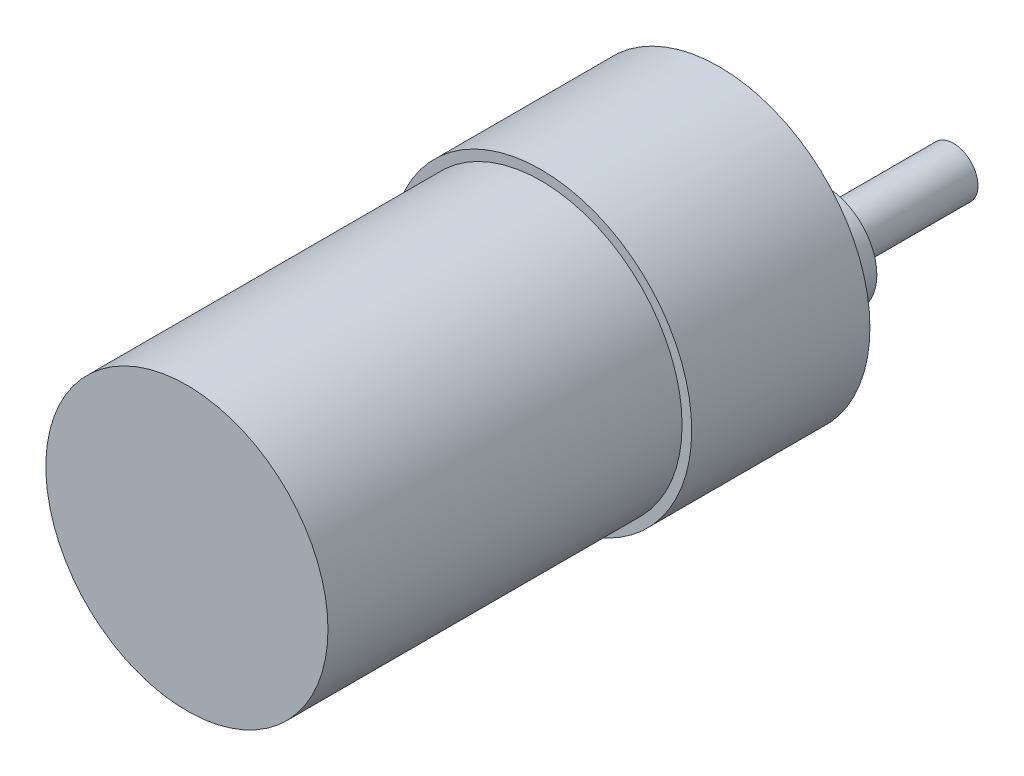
ISO-10303-21;
HEADER;
FILE_DESCRIPTION(('STEP AP214'),'2;1');
FILE_NAME('part.step','',(''),(''),'','','');
FILE_SCHEMA(('AUTOMOTIVE_DESIGN { 1 0 10303 214 1 1 1 1 }'));
ENDSEC;
DATA;
#1=APPLICATION_CONTEXT('core data for automotive mechanical design processes');
#2=APPLICATION_PROTOCOL_DEFINITION('international standard','automotive_design',2000,#1);
#3=PRODUCT_CONTEXT('',#1,'mechanical');
#4=PRODUCT('Part','Part','',(#3));
#5=PRODUCT_RELATED_PRODUCT_CATEGORY('part','',(#4));
#6=PRODUCT_DEFINITION_FORMATION('','',#4);
#7=PRODUCT_DEFINITION_CONTEXT('part definition',#1,'design');
#8=PRODUCT_DEFINITION('design','',#6,#7);
#9=PRODUCT_DEFINITION_SHAPE('','',#8);
#10=(LENGTH_UNIT() NAMED_UNIT(*) SI_UNIT(.MILLI.,.METRE.));
#11=(NAMED_UNIT(*) PLANE_ANGLE_UNIT() SI_UNIT($,.RADIAN.));
#12=(NAMED_UNIT(*) SI_UNIT($,.STERADIAN.) SOLID_ANGLE_UNIT());
#13=UNCERTAINTY_MEASURE_WITH_UNIT(LENGTH_MEASURE(1.E-05),#10,'distance_accuracy_value','');
#14=(GEOMETRIC_REPRESENTATION_CONTEXT(3) GLOBAL_UNCERTAINTY_ASSIGNED_CONTEXT((#13)) GLOBAL_UNIT_ASSIGNED_CONTEXT((#10,
#11,#12)) REPRESENTATION_CONTEXT('',''));
#15=CARTESIAN_POINT('',(0.,0.,0.));
#16=DIRECTION('',(0.,0.,1.));
#17=DIRECTION('',(1.,0.,0.));
#18=AXIS2_PLACEMENT_3D('',#15,#16,#17);
#19=CARTESIAN_POINT('',(0.,0.,0.));
#20=DIRECTION('',(0.,0.,1.));
#21=DIRECTION('',(1.,0.,0.));
#22=AXIS2_PLACEMENT_3D('',#19,#20,#21);
#23=PLANE('',#22);
#24=CARTESIAN_POINT('',(-13.4233937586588,7.75,0.));
#25=DIRECTION('',(0.,0.,-1.));
#26=DIRECTION('',(-1.,0.,0.));
#27=AXIS2_PLACEMENT_3D('',#24,#25,#26);
#28=CIRCLE('',#27,1.49999999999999);
#29=CARTESIAN_POINT('',(-14.9233937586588,7.75,0.));
#30=VERTEX_POINT('',#29);
#31=EDGE_CURVE('E483',#30,#30,#28,.T.);
#32=ORIENTED_EDGE('',*,*,#31,.F.);
#33=EDGE_LOOP('',(#32));
#34=FACE_BOUND('',#33,.T.);
#35=CARTESIAN_POINT('',(0.,15.5,0.));
#36=DIRECTION('',(0.,0.,-1.));
#37=DIRECTION('',(-1.,0.,0.));
#38=AXIS2_PLACEMENT_3D('',#35,#36,#37);
#39=CIRCLE('',#38,1.49999999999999);
#40=CARTESIAN_POINT('',(-1.49999999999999,15.5,0.));
#41=VERTEX_POINT('',#40);
#42=EDGE_CURVE('E74',#41,#41,#39,.T.);
#43=ORIENTED_EDGE('',*,*,#42,.F.);
#44=EDGE_LOOP('',(#43));
#45=FACE_BOUND('',#44,.T.);
#46=CARTESIAN_POINT('',(13.4233937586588,7.75000000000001,0.));
#47=DIRECTION('',(0.,0.,-1.));
#48=DIRECTION('',(-1.,0.,0.));
#49=AXIS2_PLACEMENT_3D('',#46,#47,#48);
#50=CIRCLE('',#49,1.49999999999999);
#51=CARTESIAN_POINT('',(11.9233937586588,7.75000000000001,0.));
#52=VERTEX_POINT('',#51);
#53=EDGE_CURVE('E93',#52,#52,#50,.T.);
#54=ORIENTED_EDGE('',*,*,#53,.F.);
#55=EDGE_LOOP('',(#54));
#56=FACE_BOUND('',#55,.T.);
#57=CARTESIAN_POINT('',(13.4233937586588,-7.75,0.));
#58=DIRECTION('',(0.,0.,-1.));
#59=DIRECTION('',(-1.,0.,0.));
#60=AXIS2_PLACEMENT_3D('',#57,#58,#59);
#61=CIRCLE('',#60,1.49999999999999);
#62=CARTESIAN_POINT('',(11.9233937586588,-7.75,0.));
#63=VERTEX_POINT('',#62);
#64=EDGE_CURVE('E105',#63,#63,#61,.T.);
#65=ORIENTED_EDGE('',*,*,#64,.F.);
#66=EDGE_LOOP('',(#65));
#67=FACE_BOUND('',#66,.T.);
#68=CARTESIAN_POINT('',(0.,-15.5,0.));
#69=DIRECTION('',(0.,0.,-1.));
#70=DIRECTION('',(-1.,0.,0.));
#71=AXIS2_PLACEMENT_3D('',#68,#69,#70);
#72=CIRCLE('',#71,1.49999999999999);
#73=CARTESIAN_POINT('',(-1.49999999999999,-15.5,0.));
#74=VERTEX_POINT('',#73);
#75=EDGE_CURVE('E117',#74,#74,#72,.T.);
#76=ORIENTED_EDGE('',*,*,#75,.F.);
#77=EDGE_LOOP('',(#76));
#78=FACE_BOUND('',#77,.T.);
#79=CARTESIAN_POINT('',(-13.4233937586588,-7.75000000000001,0.));
#80=DIRECTION('',(0.,0.,-1.));
#81=DIRECTION('',(-1.,0.,0.));
#82=AXIS2_PLACEMENT_3D('',#79,#80,#81);
#83=CIRCLE('',#82,1.49999999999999);
#84=CARTESIAN_POINT('',(-14.9233937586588,-7.75000000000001,0.));
#85=VERTEX_POINT('',#84);
#86=EDGE_CURVE('E129',#85,#85,#83,.T.);
#87=ORIENTED_EDGE('',*,*,#86,.F.);
#88=EDGE_LOOP('',(#87));
#89=FACE_BOUND('',#88,.T.);
#90=CARTESIAN_POINT('',(0.,0.,0.));
#91=DIRECTION('',(0.,0.,1.));
#92=DIRECTION('',(1.,0.,0.));
#93=AXIS2_PLACEMENT_3D('',#90,#91,#92);
#94=CIRCLE('',#93,18.4);
#95=CARTESIAN_POINT('',(18.4,0.,0.));
#96=VERTEX_POINT('',#95);
#97=EDGE_CURVE('E156',#96,#96,#94,.T.);
#98=ORIENTED_EDGE('',*,*,#97,.F.);
#99=EDGE_LOOP('',(#98));
#100=FACE_BOUND('',#99,.T.);
#101=CARTESIAN_POINT('',(7.,0.,0.));
#102=DIRECTION('',(0.,0.,1.));
#103=DIRECTION('',(1.,0.,0.));
#104=AXIS2_PLACEMENT_3D('',#101,#102,#103);
#105=CIRCLE('',#104,6.25);
#106=CARTESIAN_POINT('',(13.25,0.,0.));
#107=VERTEX_POINT('',#106);
#108=EDGE_CURVE('E11',#107,#107,#105,.F.);
#109=ORIENTED_EDGE('',*,*,#108,.F.);
#110=EDGE_LOOP('',(#109));
#111=FACE_BOUND('',#110,.T.);
#112=ADVANCED_FACE('F37',(#34,#45,#56,#67,#78,#89,#100,#111),#23,.F.);
#113=CARTESIAN_POINT('',(0.,0.,21.76));
#114=DIRECTION('',(0.,0.,1.));
#115=DIRECTION('',(1.,0.,0.));
#116=AXIS2_PLACEMENT_3D('',#113,#114,#115);
#117=PLANE('',#116);
#118=CARTESIAN_POINT('',(0.,0.,21.76));
#119=DIRECTION('',(0.,0.,1.));
#120=DIRECTION('',(1.,0.,0.));
#121=AXIS2_PLACEMENT_3D('',#118,#119,#120);
#122=CIRCLE('',#121,18.4);
#123=CARTESIAN_POINT('',(18.4,0.,21.76));
#124=VERTEX_POINT('',#123);
#125=EDGE_CURVE('E45',#124,#124,#122,.T.);
#126=ORIENTED_EDGE('',*,*,#125,.T.);
#127=EDGE_LOOP('',(#126));
#128=FACE_BOUND('',#127,.T.);
#129=CARTESIAN_POINT('',(0.,0.,21.76));
#130=DIRECTION('',(0.,0.,1.));
#131=DIRECTION('',(1.,0.,0.));
#132=AXIS2_PLACEMENT_3D('',#129,#130,#131);
#133=CIRCLE('',#132,17.225);
#134=CARTESIAN_POINT('',(17.225,0.,21.76));
#135=VERTEX_POINT('',#134);
#136=EDGE_CURVE('E153',#135,#135,#133,.F.);
#137=ORIENTED_EDGE('',*,*,#136,.T.);
#138=EDGE_LOOP('',(#137));
#139=FACE_BOUND('',#138,.T.);
#140=ADVANCED_FACE('F164',(#128,#139),#117,.T.);
#141=CARTESIAN_POINT('',(0.,0.,21.76));
#142=DIRECTION('',(0.,0.,-1.));
#143=DIRECTION('',(-1.,0.,0.));
#144=AXIS2_PLACEMENT_3D('',#141,#142,#143);
#145=CYLINDRICAL_SURFACE('',#144,18.4);
#146=ORIENTED_EDGE('',*,*,#125,.F.);
#147=EDGE_LOOP('',(#146));
#148=FACE_BOUND('',#147,.T.);
#149=ORIENTED_EDGE('',*,*,#97,.T.);
#150=EDGE_LOOP('',(#149));
#151=FACE_BOUND('',#150,.T.);
#152=ADVANCED_FACE('F39',(#148,#151),#145,.T.);
#153=CARTESIAN_POINT('',(0.,0.,65.));
#154=DIRECTION('',(0.,0.,-1.));
#155=DIRECTION('',(-1.,0.,0.));
#156=AXIS2_PLACEMENT_3D('',#153,#154,#155);
#157=CYLINDRICAL_SURFACE('',#156,17.225);
#158=ORIENTED_EDGE('',*,*,#136,.F.);
#159=EDGE_LOOP('',(#158));
#160=FACE_BOUND('',#159,.T.);
#161=CARTESIAN_POINT('',(0.,0.,65.));
#162=DIRECTION('',(0.,0.,1.));
#163=DIRECTION('',(1.,0.,0.));
#164=AXIS2_PLACEMENT_3D('',#161,#162,#163);
#165=CIRCLE('',#164,17.225);
#166=CARTESIAN_POINT('',(17.225,0.,65.));
#167=VERTEX_POINT('',#166);
#168=EDGE_CURVE('E150',#167,#167,#165,.T.);
#169=ORIENTED_EDGE('',*,*,#168,.F.);
#170=EDGE_LOOP('',(#169));
#171=FACE_BOUND('',#170,.T.);
#172=ADVANCED_FACE('F200',(#160,#171),#157,.T.);
#173=CARTESIAN_POINT('',(0.,0.,65.));
#174=DIRECTION('',(0.,0.,1.));
#175=DIRECTION('',(1.,0.,0.));
#176=AXIS2_PLACEMENT_3D('',#173,#174,#175);
#177=PLANE('',#176);
#178=ORIENTED_EDGE('',*,*,#168,.T.);
#179=EDGE_LOOP('',(#178));
#180=FACE_BOUND('',#179,.T.);
#181=ADVANCED_FACE('F184',(#180),#177,.T.);
#182=CARTESIAN_POINT('',(7.,0.,0.));
#183=DIRECTION('',(0.,0.,1.));
#184=DIRECTION('',(1.,0.,0.));
#185=AXIS2_PLACEMENT_3D('',#182,#183,#184);
#186=CYLINDRICAL_SURFACE('',#185,3.);
#187=CARTESIAN_POINT('',(7.,0.,-6.));
#188=DIRECTION('',(0.,0.,1.));
#189=DIRECTION('',(1.,0.,0.));
#190=AXIS2_PLACEMENT_3D('',#187,#188,#189);
#191=CIRCLE('',#190,3.);
#192=CARTESIAN_POINT('',(10.,0.,-6.));
#193=VERTEX_POINT('',#192);
#194=EDGE_CURVE('E147',#193,#193,#191,.T.);
#195=ORIENTED_EDGE('',*,*,#194,.F.);
#196=EDGE_LOOP('',(#195));
#197=FACE_BOUND('',#196,.T.);
#198=CARTESIAN_POINT('',(7.,0.,-21.6));
#199=DIRECTION('',(0.,0.,1.));
#200=DIRECTION('',(1.,0.,0.));
#201=AXIS2_PLACEMENT_3D('',#198,#199,#200);
#202=CIRCLE('',#201,3.);
#203=CARTESIAN_POINT('',(10.,0.,-21.6));
#204=VERTEX_POINT('',#203);
#205=EDGE_CURVE('E141',#204,#204,#202,.T.);
#206=ORIENTED_EDGE('',*,*,#205,.T.);
#207=EDGE_LOOP('',(#206));
#208=FACE_BOUND('',#207,.T.);
#209=ADVANCED_FACE('F178',(#197,#208),#186,.T.);
#210=CARTESIAN_POINT('',(0.749999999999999,0.,-6.));
#211=DIRECTION('',(0.,0.,1.));
#212=DIRECTION('',(1.,0.,0.));
#213=AXIS2_PLACEMENT_3D('',#210,#211,#212);
#214=PLANE('',#213);
#215=CARTESIAN_POINT('',(7.,0.,-6.));
#216=DIRECTION('',(0.,0.,1.));
#217=DIRECTION('',(1.,0.,0.));
#218=AXIS2_PLACEMENT_3D('',#215,#216,#217);
#219=CIRCLE('',#218,6.25);
#220=CARTESIAN_POINT('',(13.25,0.,-6.));
#221=VERTEX_POINT('',#220);
#222=EDGE_CURVE('E144',#221,#221,#219,.T.);
#223=ORIENTED_EDGE('',*,*,#222,.F.);
#224=EDGE_LOOP('',(#223));
#225=FACE_BOUND('',#224,.T.);
#226=ORIENTED_EDGE('',*,*,#194,.T.);
#227=EDGE_LOOP('',(#226));
#228=FACE_BOUND('',#227,.T.);
#229=ADVANCED_FACE('F172',(#225,#228),#214,.F.);
#230=CARTESIAN_POINT('',(7.,0.,0.));
#231=DIRECTION('',(0.,0.,1.));
#232=DIRECTION('',(1.,0.,0.));
#233=AXIS2_PLACEMENT_3D('',#230,#231,#232);
#234=CYLINDRICAL_SURFACE('',#233,6.25);
#235=ORIENTED_EDGE('',*,*,#108,.T.);
#236=EDGE_LOOP('',(#235));
#237=FACE_BOUND('',#236,.T.);
#238=ORIENTED_EDGE('',*,*,#222,.T.);
#239=EDGE_LOOP('',(#238));
#240=FACE_BOUND('',#239,.T.);
#241=ADVANCED_FACE('F168',(#237,#240),#234,.T.);
#242=CARTESIAN_POINT('',(4.,0.,-21.6));
#243=DIRECTION('',(0.,0.,1.));
#244=DIRECTION('',(1.,0.,0.));
#245=AXIS2_PLACEMENT_3D('',#242,#243,#244);
#246=PLANE('',#245);
#247=ORIENTED_EDGE('',*,*,#205,.F.);
#248=EDGE_LOOP('',(#247));
#249=FACE_BOUND('',#248,.T.);
#250=ADVANCED_FACE('F171',(#249),#246,.F.);
#251=CARTESIAN_POINT('',(-13.4233937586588,-7.75000000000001,4.));
#252=DIRECTION('',(0.,0.,-1.));
#253=DIRECTION('',(-1.,0.,0.));
#254=AXIS2_PLACEMENT_3D('',#251,#252,#253);
#255=CONICAL_SURFACE('',#254,1.25,1.02974425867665);
#256=CARTESIAN_POINT('',(-13.4233937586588,-7.75000000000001,4.75107577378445));
#257=VERTEX_POINT('',#256);
#258=VERTEX_LOOP('',#257);
#259=FACE_BOUND('',#258,.T.);
#260=CARTESIAN_POINT('',(-13.4233937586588,-7.75000000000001,4.));
#261=DIRECTION('',(0.,0.,-1.));
#262=DIRECTION('',(-1.,0.,0.));
#263=AXIS2_PLACEMENT_3D('',#260,#261,#262);
#264=CIRCLE('',#263,1.25);
#265=CARTESIAN_POINT('',(-14.6733937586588,-7.75000000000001,4.));
#266=VERTEX_POINT('',#265);
#267=EDGE_CURVE('E138',#266,#266,#264,.T.);
#268=ORIENTED_EDGE('',*,*,#267,.T.);
#269=EDGE_LOOP('',(#268));
#270=FACE_BOUND('',#269,.T.);
#271=ADVANCED_FACE('F189',(#259,#270),#255,.F.);
#272=CARTESIAN_POINT('',(-13.4233937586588,-7.75000000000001,0.));
#273=DIRECTION('',(0.,0.,-1.));
#274=DIRECTION('',(-1.,0.,0.));
#275=AXIS2_PLACEMENT_3D('',#272,#273,#274);
#276=CYLINDRICAL_SURFACE('',#275,1.25);
#277=ORIENTED_EDGE('',*,*,#267,.F.);
#278=EDGE_LOOP('',(#277));
#279=FACE_BOUND('',#278,.T.);
#280=CARTESIAN_POINT('',(-13.4233937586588,-7.75000000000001,3.5));
#281=DIRECTION('',(0.,0.,-1.));
#282=DIRECTION('',(-1.,0.,0.));
#283=AXIS2_PLACEMENT_3D('',#280,#281,#282);
#284=CIRCLE('',#283,1.25);
#285=CARTESIAN_POINT('',(-14.6733937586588,-7.75000000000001,3.5));
#286=VERTEX_POINT('',#285);
#287=EDGE_CURVE('E135',#286,#286,#284,.T.);
#288=ORIENTED_EDGE('',*,*,#287,.T.);
#289=EDGE_LOOP('',(#288));
#290=FACE_BOUND('',#289,.T.);
#291=ADVANCED_FACE('F194',(#279,#290),#276,.F.);
#292=CARTESIAN_POINT('',(-12.1733937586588,-7.75000000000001,3.5));
#293=DIRECTION('',(0.,0.,1.));
#294=DIRECTION('',(1.,0.,0.));
#295=AXIS2_PLACEMENT_3D('',#292,#293,#294);
#296=PLANE('',#295);
#297=ORIENTED_EDGE('',*,*,#287,.F.);
#298=EDGE_LOOP('',(#297));
#299=FACE_BOUND('',#298,.T.);
#300=CARTESIAN_POINT('',(-13.4233937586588,-7.75000000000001,3.5));
#301=DIRECTION('',(0.,0.,-1.));
#302=DIRECTION('',(-1.,0.,0.));
#303=AXIS2_PLACEMENT_3D('',#300,#301,#302);
#304=CIRCLE('',#303,1.5);
#305=CARTESIAN_POINT('',(-14.9233937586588,-7.75000000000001,3.5));
#306=VERTEX_POINT('',#305);
#307=EDGE_CURVE('E132',#306,#306,#304,.T.);
#308=ORIENTED_EDGE('',*,*,#307,.T.);
#309=EDGE_LOOP('',(#308));
#310=FACE_BOUND('',#309,.T.);
#311=ADVANCED_FACE('F263',(#299,#310),#296,.F.);
#312=CARTESIAN_POINT('',(-13.4233937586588,-7.75000000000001,0.));
#313=DIRECTION('',(0.,0.,-1.));
#314=DIRECTION('',(-1.,0.,0.));
#315=AXIS2_PLACEMENT_3D('',#312,#313,#314);
#316=CYLINDRICAL_SURFACE('',#315,1.5);
#317=ORIENTED_EDGE('',*,*,#307,.F.);
#318=EDGE_LOOP('',(#317));
#319=FACE_BOUND('',#318,.T.);
#320=ORIENTED_EDGE('',*,*,#86,.T.);
#321=EDGE_LOOP('',(#320));
#322=FACE_BOUND('',#321,.T.);
#323=ADVANCED_FACE('F272',(#319,#322),#316,.F.);
#324=CARTESIAN_POINT('',(0.,-15.5,4.));
#325=DIRECTION('',(0.,0.,-1.));
#326=DIRECTION('',(-1.,0.,0.));
#327=AXIS2_PLACEMENT_3D('',#324,#325,#326);
#328=CONICAL_SURFACE('',#327,1.25,1.02974425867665);
#329=CARTESIAN_POINT('',(0.,-15.5,4.75107577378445));
#330=VERTEX_POINT('',#329);
#331=VERTEX_LOOP('',#330);
#332=FACE_BOUND('',#331,.T.);
#333=CARTESIAN_POINT('',(0.,-15.5,4.));
#334=DIRECTION('',(0.,0.,-1.));
#335=DIRECTION('',(-1.,0.,0.));
#336=AXIS2_PLACEMENT_3D('',#333,#334,#335);
#337=CIRCLE('',#336,1.25);
#338=CARTESIAN_POINT('',(-1.25,-15.5,4.));
#339=VERTEX_POINT('',#338);
#340=EDGE_CURVE('E126',#339,#339,#337,.T.);
#341=ORIENTED_EDGE('',*,*,#340,.T.);
#342=EDGE_LOOP('',(#341));
#343=FACE_BOUND('',#342,.T.);
#344=ADVANCED_FACE('F282',(#332,#343),#328,.F.);
#345=CARTESIAN_POINT('',(0.,-15.5,0.));
#346=DIRECTION('',(0.,0.,-1.));
#347=DIRECTION('',(-1.,0.,0.));
#348=AXIS2_PLACEMENT_3D('',#345,#346,#347);
#349=CYLINDRICAL_SURFACE('',#348,1.25);
#350=ORIENTED_EDGE('',*,*,#340,.F.);
#351=EDGE_LOOP('',(#350));
#352=FACE_BOUND('',#351,.T.);
#353=CARTESIAN_POINT('',(0.,-15.5,3.5));
#354=DIRECTION('',(0.,0.,-1.));
#355=DIRECTION('',(-1.,0.,0.));
#356=AXIS2_PLACEMENT_3D('',#353,#354,#355);
#357=CIRCLE('',#356,1.25);
#358=CARTESIAN_POINT('',(-1.25,-15.5,3.5));
#359=VERTEX_POINT('',#358);
#360=EDGE_CURVE('E123',#359,#359,#357,.T.);
#361=ORIENTED_EDGE('',*,*,#360,.T.);
#362=EDGE_LOOP('',(#361));
#363=FACE_BOUND('',#362,.T.);
#364=ADVANCED_FACE('F292',(#352,#363),#349,.F.);
#365=CARTESIAN_POINT('',(1.25,-15.5,3.5));
#366=DIRECTION('',(0.,0.,1.));
#367=DIRECTION('',(1.,0.,0.));
#368=AXIS2_PLACEMENT_3D('',#365,#366,#367);
#369=PLANE('',#368);
#370=ORIENTED_EDGE('',*,*,#360,.F.);
#371=EDGE_LOOP('',(#370));
#372=FACE_BOUND('',#371,.T.);
#373=CARTESIAN_POINT('',(0.,-15.5,3.5));
#374=DIRECTION('',(0.,0.,-1.));
#375=DIRECTION('',(-1.,0.,0.));
#376=AXIS2_PLACEMENT_3D('',#373,#374,#375);
#377=CIRCLE('',#376,1.5);
#378=CARTESIAN_POINT('',(-1.5,-15.5,3.5));
#379=VERTEX_POINT('',#378);
#380=EDGE_CURVE('E120',#379,#379,#377,.T.);
#381=ORIENTED_EDGE('',*,*,#380,.T.);
#382=EDGE_LOOP('',(#381));
#383=FACE_BOUND('',#382,.T.);
#384=ADVANCED_FACE('F301',(#372,#383),#369,.F.);
#385=CARTESIAN_POINT('',(0.,-15.5,0.));
#386=DIRECTION('',(0.,0.,-1.));
#387=DIRECTION('',(-1.,0.,0.));
#388=AXIS2_PLACEMENT_3D('',#385,#386,#387);
#389=CYLINDRICAL_SURFACE('',#388,1.5);
#390=ORIENTED_EDGE('',*,*,#380,.F.);
#391=EDGE_LOOP('',(#390));
#392=FACE_BOUND('',#391,.T.);
#393=ORIENTED_EDGE('',*,*,#75,.T.);
#394=EDGE_LOOP('',(#393));
#395=FACE_BOUND('',#394,.T.);
#396=ADVANCED_FACE('F311',(#392,#395),#389,.F.);
#397=CARTESIAN_POINT('',(13.4233937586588,-7.75,4.));
#398=DIRECTION('',(0.,0.,-1.));
#399=DIRECTION('',(-1.,0.,0.));
#400=AXIS2_PLACEMENT_3D('',#397,#398,#399);
#401=CONICAL_SURFACE('',#400,1.25,1.02974425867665);
#402=CARTESIAN_POINT('',(13.4233937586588,-7.75,4.75107577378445));
#403=VERTEX_POINT('',#402);
#404=VERTEX_LOOP('',#403);
#405=FACE_BOUND('',#404,.T.);
#406=CARTESIAN_POINT('',(13.4233937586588,-7.75,4.));
#407=DIRECTION('',(0.,0.,-1.));
#408=DIRECTION('',(-1.,0.,0.));
#409=AXIS2_PLACEMENT_3D('',#406,#407,#408);
#410=CIRCLE('',#409,1.25);
#411=CARTESIAN_POINT('',(12.1733937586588,-7.75,4.));
#412=VERTEX_POINT('',#411);
#413=EDGE_CURVE('E114',#412,#412,#410,.T.);
#414=ORIENTED_EDGE('',*,*,#413,.T.);
#415=EDGE_LOOP('',(#414));
#416=FACE_BOUND('',#415,.T.);
#417=ADVANCED_FACE('F321',(#405,#416),#401,.F.);
#418=CARTESIAN_POINT('',(13.4233937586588,-7.75,0.));
#419=DIRECTION('',(0.,0.,-1.));
#420=DIRECTION('',(-1.,0.,0.));
#421=AXIS2_PLACEMENT_3D('',#418,#419,#420);
#422=CYLINDRICAL_SURFACE('',#421,1.25);
#423=ORIENTED_EDGE('',*,*,#413,.F.);
#424=EDGE_LOOP('',(#423));
#425=FACE_BOUND('',#424,.T.);
#426=CARTESIAN_POINT('',(13.4233937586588,-7.75,3.5));
#427=DIRECTION('',(0.,0.,-1.));
#428=DIRECTION('',(-1.,0.,0.));
#429=AXIS2_PLACEMENT_3D('',#426,#427,#428);
#430=CIRCLE('',#429,1.25);
#431=CARTESIAN_POINT('',(12.1733937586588,-7.75,3.5));
#432=VERTEX_POINT('',#431);
#433=EDGE_CURVE('E111',#432,#432,#430,.T.);
#434=ORIENTED_EDGE('',*,*,#433,.T.);
#435=EDGE_LOOP('',(#434));
#436=FACE_BOUND('',#435,.T.);
#437=ADVANCED_FACE('F331',(#425,#436),#422,.F.);
#438=CARTESIAN_POINT('',(14.6733937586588,-7.75,3.5));
#439=DIRECTION('',(0.,0.,1.));
#440=DIRECTION('',(1.,0.,0.));
#441=AXIS2_PLACEMENT_3D('',#438,#439,#440);
#442=PLANE('',#441);
#443=ORIENTED_EDGE('',*,*,#433,.F.);
#444=EDGE_LOOP('',(#443));
#445=FACE_BOUND('',#444,.T.);
#446=CARTESIAN_POINT('',(13.4233937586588,-7.75,3.5));
#447=DIRECTION('',(0.,0.,-1.));
#448=DIRECTION('',(-1.,0.,0.));
#449=AXIS2_PLACEMENT_3D('',#446,#447,#448);
#450=CIRCLE('',#449,1.5);
#451=CARTESIAN_POINT('',(11.9233937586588,-7.75,3.5));
#452=VERTEX_POINT('',#451);
#453=EDGE_CURVE('E108',#452,#452,#450,.T.);
#454=ORIENTED_EDGE('',*,*,#453,.T.);
#455=EDGE_LOOP('',(#454));
#456=FACE_BOUND('',#455,.T.);
#457=ADVANCED_FACE('F341',(#445,#456),#442,.F.);
#458=CARTESIAN_POINT('',(13.4233937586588,-7.75,0.));
#459=DIRECTION('',(0.,0.,-1.));
#460=DIRECTION('',(-1.,0.,0.));
#461=AXIS2_PLACEMENT_3D('',#458,#459,#460);
#462=CYLINDRICAL_SURFACE('',#461,1.5);
#463=ORIENTED_EDGE('',*,*,#453,.F.);
#464=EDGE_LOOP('',(#463));
#465=FACE_BOUND('',#464,.T.);
#466=ORIENTED_EDGE('',*,*,#64,.T.);
#467=EDGE_LOOP('',(#466));
#468=FACE_BOUND('',#467,.T.);
#469=ADVANCED_FACE('F351',(#465,#468),#462,.F.);
#470=CARTESIAN_POINT('',(13.4233937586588,7.75000000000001,4.));
#471=DIRECTION('',(0.,0.,-1.));
#472=DIRECTION('',(-1.,0.,0.));
#473=AXIS2_PLACEMENT_3D('',#470,#471,#472);
#474=CONICAL_SURFACE('',#473,1.25,1.02974425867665);
#475=CARTESIAN_POINT('',(13.4233937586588,7.75000000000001,4.75107577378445));
#476=VERTEX_POINT('',#475);
#477=VERTEX_LOOP('',#476);
#478=FACE_BOUND('',#477,.T.);
#479=CARTESIAN_POINT('',(13.4233937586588,7.75000000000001,4.));
#480=DIRECTION('',(0.,0.,-1.));
#481=DIRECTION('',(-1.,0.,0.));
#482=AXIS2_PLACEMENT_3D('',#479,#480,#481);
#483=CIRCLE('',#482,1.25);
#484=CARTESIAN_POINT('',(12.1733937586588,7.75000000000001,4.));
#485=VERTEX_POINT('',#484);
#486=EDGE_CURVE('E102',#485,#485,#483,.T.);
#487=ORIENTED_EDGE('',*,*,#486,.T.);
#488=EDGE_LOOP('',(#487));
#489=FACE_BOUND('',#488,.T.);
#490=ADVANCED_FACE('F361',(#478,#489),#474,.F.);
#491=CARTESIAN_POINT('',(13.4233937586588,7.75000000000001,0.));
#492=DIRECTION('',(0.,0.,-1.));
#493=DIRECTION('',(-1.,0.,0.));
#494=AXIS2_PLACEMENT_3D('',#491,#492,#493);
#495=CYLINDRICAL_SURFACE('',#494,1.25);
#496=ORIENTED_EDGE('',*,*,#486,.F.);
#497=EDGE_LOOP('',(#496));
#498=FACE_BOUND('',#497,.T.);
#499=CARTESIAN_POINT('',(13.4233937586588,7.75000000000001,3.5));
#500=DIRECTION('',(0.,0.,-1.));
#501=DIRECTION('',(-1.,0.,0.));
#502=AXIS2_PLACEMENT_3D('',#499,#500,#501);
#503=CIRCLE('',#502,1.25);
#504=CARTESIAN_POINT('',(12.1733937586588,7.75000000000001,3.5));
#505=VERTEX_POINT('',#504);
#506=EDGE_CURVE('E99',#505,#505,#503,.T.);
#507=ORIENTED_EDGE('',*,*,#506,.T.);
#508=EDGE_LOOP('',(#507));
#509=FACE_BOUND('',#508,.T.);
#510=ADVANCED_FACE('F371',(#498,#509),#495,.F.);
#511=CARTESIAN_POINT('',(14.6733937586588,7.75000000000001,3.5));
#512=DIRECTION('',(0.,0.,1.));
#513=DIRECTION('',(1.,0.,0.));
#514=AXIS2_PLACEMENT_3D('',#511,#512,#513);
#515=PLANE('',#514);
#516=ORIENTED_EDGE('',*,*,#506,.F.);
#517=EDGE_LOOP('',(#516));
#518=FACE_BOUND('',#517,.T.);
#519=CARTESIAN_POINT('',(13.4233937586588,7.75000000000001,3.5));
#520=DIRECTION('',(0.,0.,-1.));
#521=DIRECTION('',(-1.,0.,0.));
#522=AXIS2_PLACEMENT_3D('',#519,#520,#521);
#523=CIRCLE('',#522,1.5);
#524=CARTESIAN_POINT('',(11.9233937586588,7.75000000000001,3.5));
#525=VERTEX_POINT('',#524);
#526=EDGE_CURVE('E96',#525,#525,#523,.T.);
#527=ORIENTED_EDGE('',*,*,#526,.T.);
#528=EDGE_LOOP('',(#527));
#529=FACE_BOUND('',#528,.T.);
#530=ADVANCED_FACE('F381',(#518,#529),#515,.F.);
#531=CARTESIAN_POINT('',(13.4233937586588,7.75000000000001,0.));
#532=DIRECTION('',(0.,0.,-1.));
#533=DIRECTION('',(-1.,0.,0.));
#534=AXIS2_PLACEMENT_3D('',#531,#532,#533);
#535=CYLINDRICAL_SURFACE('',#534,1.5);
#536=ORIENTED_EDGE('',*,*,#526,.F.);
#537=EDGE_LOOP('',(#536));
#538=FACE_BOUND('',#537,.T.);
#539=ORIENTED_EDGE('',*,*,#53,.T.);
#540=EDGE_LOOP('',(#539));
#541=FACE_BOUND('',#540,.T.);
#542=ADVANCED_FACE('F391',(#538,#541),#535,.F.);
#543=CARTESIAN_POINT('',(0.,15.5,4.));
#544=DIRECTION('',(0.,0.,-1.));
#545=DIRECTION('',(-1.,0.,0.));
#546=AXIS2_PLACEMENT_3D('',#543,#544,#545);
#547=CONICAL_SURFACE('',#546,1.25,1.02974425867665);
#548=CARTESIAN_POINT('',(0.,15.5,4.75107577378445));
#549=VERTEX_POINT('',#548);
#550=VERTEX_LOOP('',#549);
#551=FACE_BOUND('',#550,.T.);
#552=CARTESIAN_POINT('',(0.,15.5,4.));
#553=DIRECTION('',(0.,0.,-1.));
#554=DIRECTION('',(-1.,0.,0.));
#555=AXIS2_PLACEMENT_3D('',#552,#553,#554);
#556=CIRCLE('',#555,1.25);
#557=CARTESIAN_POINT('',(-1.25,15.5,4.));
#558=VERTEX_POINT('',#557);
#559=EDGE_CURVE('E90',#558,#558,#556,.T.);
#560=ORIENTED_EDGE('',*,*,#559,.T.);
#561=EDGE_LOOP('',(#560));
#562=FACE_BOUND('',#561,.T.);
#563=ADVANCED_FACE('F401',(#551,#562),#547,.F.);
#564=CARTESIAN_POINT('',(0.,15.5,0.));
#565=DIRECTION('',(0.,0.,-1.));
#566=DIRECTION('',(-1.,0.,0.));
#567=AXIS2_PLACEMENT_3D('',#564,#565,#566);
#568=CYLINDRICAL_SURFACE('',#567,1.25);
#569=ORIENTED_EDGE('',*,*,#559,.F.);
#570=EDGE_LOOP('',(#569));
#571=FACE_BOUND('',#570,.T.);
#572=CARTESIAN_POINT('',(0.,15.5,3.5));
#573=DIRECTION('',(0.,0.,-1.));
#574=DIRECTION('',(-1.,0.,0.));
#575=AXIS2_PLACEMENT_3D('',#572,#573,#574);
#576=CIRCLE('',#575,1.25);
#577=CARTESIAN_POINT('',(-1.25,15.5,3.5));
#578=VERTEX_POINT('',#577);
#579=EDGE_CURVE('E87',#578,#578,#576,.T.);
#580=ORIENTED_EDGE('',*,*,#579,.T.);
#581=EDGE_LOOP('',(#580));
#582=FACE_BOUND('',#581,.T.);
#583=ADVANCED_FACE('F411',(#571,#582),#568,.F.);
#584=CARTESIAN_POINT('',(1.25,15.5,3.5));
#585=DIRECTION('',(0.,0.,1.));
#586=DIRECTION('',(1.,0.,0.));
#587=AXIS2_PLACEMENT_3D('',#584,#585,#586);
#588=PLANE('',#587);
#589=ORIENTED_EDGE('',*,*,#579,.F.);
#590=EDGE_LOOP('',(#589));
#591=FACE_BOUND('',#590,.T.);
#592=CARTESIAN_POINT('',(0.,15.5,3.5));
#593=DIRECTION('',(0.,0.,-1.));
#594=DIRECTION('',(-1.,0.,0.));
#595=AXIS2_PLACEMENT_3D('',#592,#593,#594);
#596=CIRCLE('',#595,1.5);
#597=CARTESIAN_POINT('',(-1.5,15.5,3.5));
#598=VERTEX_POINT('',#597);
#599=EDGE_CURVE('E78',#598,#598,#596,.T.);
#600=ORIENTED_EDGE('',*,*,#599,.T.);
#601=EDGE_LOOP('',(#600));
#602=FACE_BOUND('',#601,.T.);
#603=ADVANCED_FACE('F421',(#591,#602),#588,.F.);
#604=CARTESIAN_POINT('',(0.,15.5,0.));
#605=DIRECTION('',(0.,0.,-1.));
#606=DIRECTION('',(-1.,0.,0.));
#607=AXIS2_PLACEMENT_3D('',#604,#605,#606);
#608=CYLINDRICAL_SURFACE('',#607,1.5);
#609=ORIENTED_EDGE('',*,*,#599,.F.);
#610=EDGE_LOOP('',(#609));
#611=FACE_BOUND('',#610,.T.);
#612=ORIENTED_EDGE('',*,*,#42,.T.);
#613=EDGE_LOOP('',(#612));
#614=FACE_BOUND('',#613,.T.);
#615=ADVANCED_FACE('F68',(#611,#614),#608,.F.);
#616=CARTESIAN_POINT('',(-13.4233937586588,7.75,4.));
#617=DIRECTION('',(0.,0.,-1.));
#618=DIRECTION('',(-1.,0.,0.));
#619=AXIS2_PLACEMENT_3D('',#616,#617,#618);
#620=CONICAL_SURFACE('',#619,1.25,1.02974425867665);
#621=CARTESIAN_POINT('',(-13.4233937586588,7.75,4.75107577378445));
#622=VERTEX_POINT('',#621);
#623=VERTEX_LOOP('',#622);
#624=FACE_BOUND('',#623,.T.);
#625=CARTESIAN_POINT('',(-13.4233937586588,7.75,4.));
#626=DIRECTION('',(0.,0.,-1.));
#627=DIRECTION('',(-1.,0.,0.));
#628=AXIS2_PLACEMENT_3D('',#625,#626,#627);
#629=CIRCLE('',#628,1.25);
#630=CARTESIAN_POINT('',(-14.6733937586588,7.75,4.));
#631=VERTEX_POINT('',#630);
#632=EDGE_CURVE('E72',#631,#631,#629,.T.);
#633=ORIENTED_EDGE('',*,*,#632,.T.);
#634=EDGE_LOOP('',(#633));
#635=FACE_BOUND('',#634,.T.);
#636=ADVANCED_FACE('F64',(#624,#635),#620,.F.);
#637=CARTESIAN_POINT('',(-13.4233937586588,7.75,0.));
#638=DIRECTION('',(0.,0.,-1.));
#639=DIRECTION('',(-1.,0.,0.));
#640=AXIS2_PLACEMENT_3D('',#637,#638,#639);
#641=CYLINDRICAL_SURFACE('',#640,1.25);
#642=ORIENTED_EDGE('',*,*,#632,.F.);
#643=EDGE_LOOP('',(#642));
#644=FACE_BOUND('',#643,.T.);
#645=CARTESIAN_POINT('',(-13.4233937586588,7.75,3.5));
#646=DIRECTION('',(0.,0.,-1.));
#647=DIRECTION('',(-1.,0.,0.));
#648=AXIS2_PLACEMENT_3D('',#645,#646,#647);
#649=CIRCLE('',#648,1.25);
#650=CARTESIAN_POINT('',(-14.6733937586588,7.75,3.5));
#651=VERTEX_POINT('',#650);
#652=EDGE_CURVE('E75',#651,#651,#649,.T.);
#653=ORIENTED_EDGE('',*,*,#652,.T.);
#654=EDGE_LOOP('',(#653));
#655=FACE_BOUND('',#654,.T.);
#656=ADVANCED_FACE('F67',(#644,#655),#641,.F.);
#657=CARTESIAN_POINT('',(-12.1733937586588,7.75,3.5));
#658=DIRECTION('',(0.,0.,1.));
#659=DIRECTION('',(1.,0.,0.));
#660=AXIS2_PLACEMENT_3D('',#657,#658,#659);
#661=PLANE('',#660);
#662=ORIENTED_EDGE('',*,*,#652,.F.);
#663=EDGE_LOOP('',(#662));
#664=FACE_BOUND('',#663,.T.);
#665=CARTESIAN_POINT('',(-13.4233937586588,7.75,3.5));
#666=DIRECTION('',(0.,0.,-1.));
#667=DIRECTION('',(-1.,0.,0.));
#668=AXIS2_PLACEMENT_3D('',#665,#666,#667);
#669=CIRCLE('',#668,1.5);
#670=CARTESIAN_POINT('',(-14.9233937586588,7.75,3.5));
#671=VERTEX_POINT('',#670);
#672=EDGE_CURVE('E81',#671,#671,#669,.T.);
#673=ORIENTED_EDGE('',*,*,#672,.T.);
#674=EDGE_LOOP('',(#673));
#675=FACE_BOUND('',#674,.T.);
#676=ADVANCED_FACE('F455',(#664,#675),#661,.F.);
#677=CARTESIAN_POINT('',(-13.4233937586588,7.75,0.));
#678=DIRECTION('',(0.,0.,-1.));
#679=DIRECTION('',(-1.,0.,0.));
#680=AXIS2_PLACEMENT_3D('',#677,#678,#679);
#681=CYLINDRICAL_SURFACE('',#680,1.5);
#682=ORIENTED_EDGE('',*,*,#672,.F.);
#683=EDGE_LOOP('',(#682));
#684=FACE_BOUND('',#683,.T.);
#685=ORIENTED_EDGE('',*,*,#31,.T.);
#686=EDGE_LOOP('',(#685));
#687=FACE_BOUND('',#686,.T.);
#688=ADVANCED_FACE('F464',(#684,#687),#681,.F.);
#689=CLOSED_SHELL('',(#112,#140,#152,#172,#181,#209,#229,#241,#250,#271,#291,#311,#323,#344,
#364,#384,#396,#417,#437,#457,#469,#490,#510,#530,#542,#563,#583,#603,#615,#636,#656,#676,#688));
#690=MANIFOLD_SOLID_BREP('B2',#689);
#691=ADVANCED_BREP_SHAPE_REPRESENTATION('',(#18,#690),#14);
#692=SHAPE_DEFINITION_REPRESENTATION(#9,#691);
ENDSEC;
END-ISO-10303-21;
